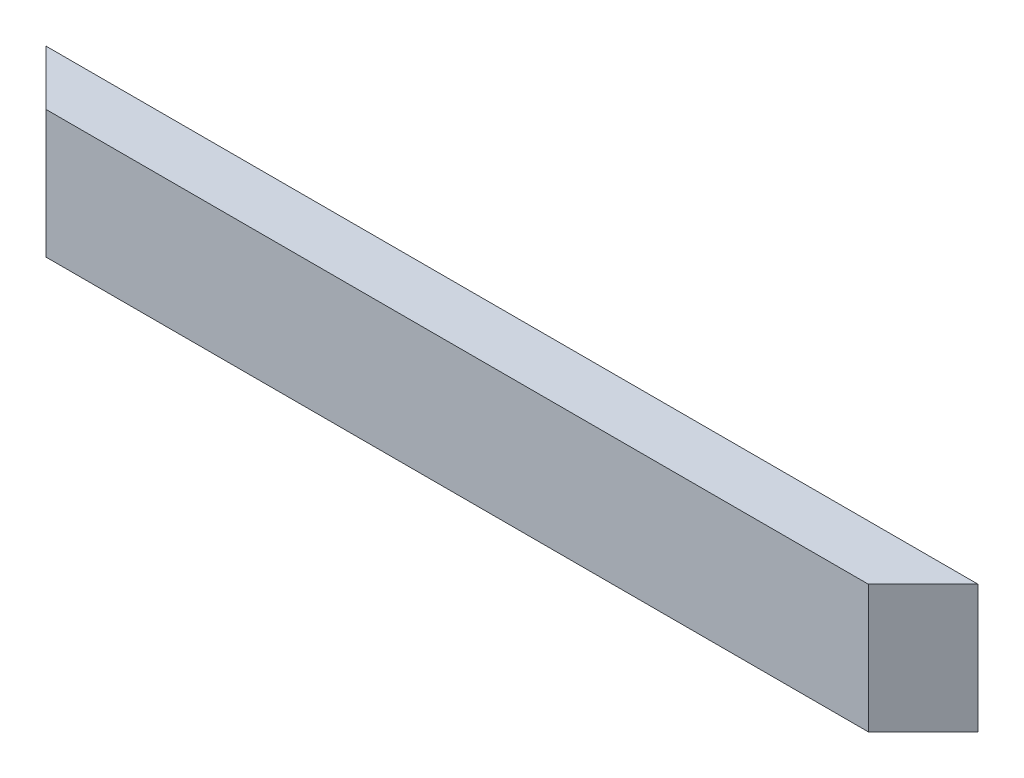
from build123d import *

# Parameters (mm, degrees)
EXTRUDE1_DEPTH = 88.9


with BuildPart() as part:
    # Sketch1 → Extrude1 (new body)
    with BuildSketch(Plane(origin=(0, 0, 0), x_dir=(1, 0, 0), z_dir=(0, 1, 0))):
        Polygon((-323.85, 19.05), (-285.75, -19.05), (285.75, -19.05), (323.85, 19.05), align=None)
    extrude(amount=EXTRUDE1_DEPTH)


solid = part.part
